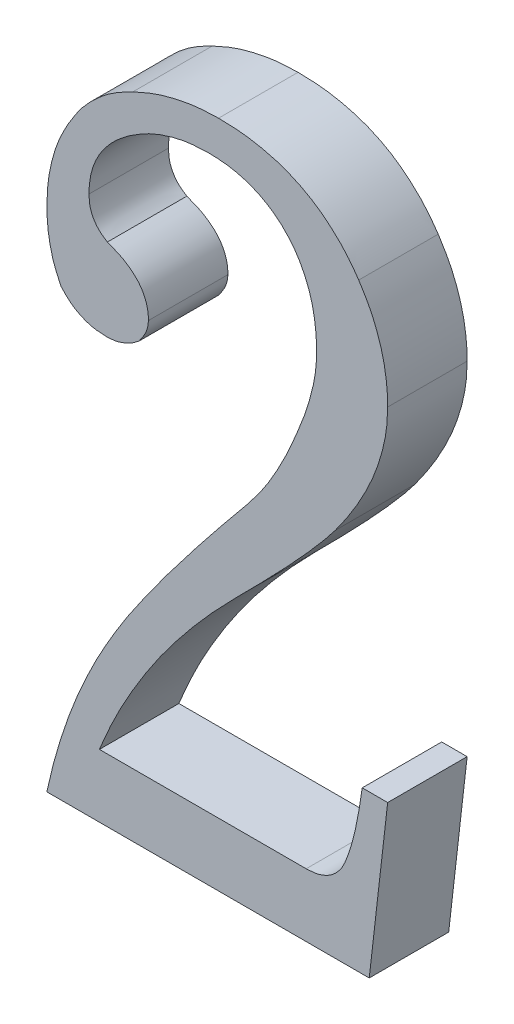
from build123d import *

# Parameters (mm, degrees)
EXTRUDE_1_DEPTH = 3


with BuildPart() as part:
    # Sketch 1 → Extrude 1 (new body)
    with BuildSketch(Plane.XY):
        with BuildLine():
            add(Edge.make_bspline(
                [(8.465608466, 23.941798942), (8.750342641, 23.935820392), (9.303283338, 23.924210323), (10.104258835, 23.789651), (10.85309588, 23.589277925), (11.547029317, 23.295097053), (12.189267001, 22.92368474), (12.769523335, 22.458755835), (13.30951138, 21.925520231), (13.60576116, 21.508596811), (13.756613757, 21.296296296)],
                knots=[0, 0, 0, 0, 1.104744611, 2.145363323, 3.145534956, 4.109100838, 5.064175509, 6.017078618, 6.990281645, 8, 8, 8, 8], degree=3))
            add(Edge.make_bspline(
                [(13.756613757, 21.296296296), (13.843155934, 21.160117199), (14.015133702, 20.88950028), (14.243146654, 20.467888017), (14.426892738, 20.031667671), (14.580773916, 19.584894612), (14.704389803, 19.12878644), (14.784691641, 18.657779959), (14.843545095, 18.178705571), (14.847245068, 17.854063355), (14.849108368, 17.690574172)],
                knots=[0, 0, 0, 0, 1.01232212, 2.011700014, 3.003325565, 3.978723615, 4.975418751, 5.964340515, 6.974845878, 8, 8, 8, 8], degree=3))
            add(Edge.make_bspline(
                [(14.849108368, 17.690574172), (14.843617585, 17.492634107), (14.832485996, 17.091345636), (14.734494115, 16.485706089), (14.575532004, 15.871974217), (14.359385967, 15.246965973), (14.07647565, 14.612659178), (13.733347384, 13.968435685), (13.329289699, 13.312108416), (13.022810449, 12.884385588), (12.864981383, 12.664119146)],
                knots=[0, 0, 0, 0, 0.864090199, 1.751790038, 2.672100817, 3.630749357, 4.636656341, 5.702335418, 6.816760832, 8, 8, 8, 8], degree=3))
            add(Edge.make_bspline(
                [(12.864981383, 12.664119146), (12.774533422, 12.545733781), (12.579214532, 12.290085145), (12.243316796, 11.897989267), (11.862200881, 11.453252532), (11.418007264, 10.970885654), (10.926825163, 10.436737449), (10.373909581, 9.862621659), (9.770032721, 9.243339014), (9.346219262, 8.817939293), (9.126984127, 8.597883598)],
                knots=[0, 0, 0, 0, 0.646827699, 1.396799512, 2.241351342, 3.190131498, 4.243902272, 5.392454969, 6.651138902, 8, 8, 8, 8], degree=3))
            add(Edge.make_bspline(
                [(9.126984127, 8.597883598), (8.836688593, 8.300089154), (8.264426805, 7.713044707), (7.467003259, 6.797686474), (6.723652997, 5.877694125), (6.046148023, 4.940911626), (5.434467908, 3.988866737), (4.878069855, 3.027924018), (4.385201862, 2.05370904), (4.106459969, 1.388182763), (3.968253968, 1.058201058)],
                knots=[0, 0, 0, 0, 1.084957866, 2.138785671, 3.166267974, 4.170334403, 5.153717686, 6.117745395, 7.066739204, 8, 8, 8, 8], degree=3))
            Line((3.968253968, 1.058201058), (11.772486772, 1.058201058))
            add(Edge.make_bspline(
                [(11.772486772, 1.058201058), (11.909291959, 1.06405076), (12.173234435, 1.075336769), (12.539354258, 1.209942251), (12.85908794, 1.420044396), (13.015247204, 1.618116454), (13.095238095, 1.71957672)],
                knots=[0, 0, 0, 0, 1.060846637, 2.046724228, 2.999455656, 4, 4, 4, 4], degree=3))
            add(Edge.make_bspline(
                [(13.095238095, 1.71957672), (13.137761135, 1.797159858), (13.228578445, 1.96285572), (13.336296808, 2.244416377), (13.444598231, 2.562925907), (13.546905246, 2.922784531), (13.644992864, 3.322804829), (13.731489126, 3.766315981), (13.814727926, 4.24983419), (13.863564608, 4.587044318), (13.888888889, 4.761904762)],
                knots=[0, 0, 0, 0, 0.6712659, 1.433636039, 2.284772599, 3.226928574, 4.27380846, 5.412206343, 6.65809859, 8, 8, 8, 8], degree=3))
            Line((13.888888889, 4.761904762), (14.849108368, 4.761904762))
            Line((14.849108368, 4.761904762), (14.153439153, -1.322751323))
            Line((14.153439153, -1.322751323), (1.984126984, -1.322751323))
            add(Edge.make_bspline(
                [(1.984126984, -1.322751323), (2.048570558, -1.034725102), (2.177037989, -0.460548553), (2.413997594, 0.387464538), (2.684686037, 1.222212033), (2.985970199, 2.046139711), (3.332163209, 2.852588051), (3.702356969, 3.649579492), (4.115572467, 4.429564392), (4.415364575, 4.937767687), (4.565941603, 5.193023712)],
                knots=[0, 0, 0, 0, 1.005727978, 2.004905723, 2.999298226, 3.995915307, 4.993417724, 5.989288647, 6.990077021, 8, 8, 8, 8], degree=3))
            add(Edge.make_bspline(
                [(4.565941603, 5.193023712), (4.691823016, 5.398112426), (4.958694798, 5.83290569), (5.415244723, 6.503901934), (5.933267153, 7.243051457), (6.52171592, 8.047592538), (7.184838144, 8.911048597), (7.90918838, 9.845083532), (8.708742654, 10.837642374), (9.268442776, 11.518240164), (9.558103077, 11.870468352)],
                knots=[0, 0, 0, 0, 0.692094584, 1.467258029, 2.333863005, 3.288414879, 4.334061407, 5.465352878, 6.68824998, 8, 8, 8, 8], degree=3))
            add(Edge.make_bspline(
                [(9.558103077, 11.870468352), (9.739161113, 12.100678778), (10.111711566, 12.574366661), (10.593990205, 13.36915119), (11.049087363, 14.239206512), (11.309923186, 14.858449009), (11.444248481, 15.177346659)],
                knots=[0, 0, 0, 0, 0.918961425, 1.890882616, 2.913846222, 4, 4, 4, 4], degree=3))
            add(Edge.make_bspline(
                [(11.444248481, 15.177346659), (11.555512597, 15.451553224), (11.767306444, 15.973511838), (11.98994019, 16.745129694), (12.141121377, 17.452802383), (12.160268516, 17.907111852), (12.169312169, 18.121693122)],
                knots=[0, 0, 0, 0, 1.163169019, 2.21411945, 3.15648574, 4, 4, 4, 4], degree=3))
            add(Edge.make_bspline(
                [(12.169312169, 18.121693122), (12.167114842, 18.28514338), (12.162819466, 18.604659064), (12.111066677, 19.071035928), (12.03499426, 19.513944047), (11.923262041, 19.931074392), (11.774563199, 20.32054872), (11.597238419, 20.684152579), (11.394425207, 21.026444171), (11.228078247, 21.229614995), (11.145404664, 21.330589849)],
                knots=[0, 0, 0, 0, 1.139425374, 2.227370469, 3.268464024, 4.271354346, 5.233786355, 6.171022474, 7.091007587, 8, 8, 8, 8], degree=3))
            add(Edge.make_bspline(
                [(11.145404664, 21.330589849), (11.049877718, 21.434371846), (10.861491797, 21.639037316), (10.537248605, 21.900638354), (10.188285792, 22.121512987), (9.813557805, 22.303819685), (9.414194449, 22.445829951), (8.989466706, 22.550232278), (8.537438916, 22.608010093), (8.227344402, 22.615313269), (8.068783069, 22.619047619)],
                knots=[0, 0, 0, 0, 0.981612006, 1.935808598, 2.892173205, 3.853869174, 4.832708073, 5.83989853, 6.895470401, 8, 8, 8, 8], degree=3))
            add(Edge.make_bspline(
                [(8.068783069, 22.619047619), (7.798148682, 22.60874386), (7.26364402, 22.588393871), (6.484981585, 22.395325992), (5.737598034, 22.101248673), (5.288230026, 21.807520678), (5.060748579, 21.65882814)],
                knots=[0, 0, 0, 0, 1.010792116, 1.996320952, 2.985687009, 4, 4, 4, 4], degree=3))
            add(Edge.make_bspline(
                [(5.060748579, 21.65882814), (4.943029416, 21.569541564), (4.713892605, 21.395747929), (4.408851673, 21.106168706), (4.150318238, 20.799198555), (3.938037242, 20.475860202), (3.774581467, 20.132677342), (3.65602766, 19.774220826), (3.586392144, 19.398130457), (3.576456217, 19.142617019), (3.571428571, 19.013325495)],
                knots=[0, 0, 0, 0, 1.120754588, 2.181515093, 3.184438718, 4.160741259, 5.108704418, 6.061113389, 7.018910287, 8, 8, 8, 8], degree=3))
            add(Edge.make_bspline(
                [(3.571428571, 19.013325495), (3.578509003, 18.882775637), (3.592022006, 18.633621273), (3.734671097, 18.29106344), (3.955294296, 17.997014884), (4.160778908, 17.862864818), (4.267097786, 17.79345483)],
                knots=[0, 0, 0, 0, 1.056783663, 2.016871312, 2.973918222, 4, 4, 4, 4], degree=3))
            add(Edge.make_bspline(
                [(4.267097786, 17.79345483), (4.388961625, 17.748642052), (4.623299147, 17.662469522), (4.943524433, 17.49820358), (5.210737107, 17.302964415), (5.437537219, 17.094524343), (5.606420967, 16.852098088), (5.730414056, 16.590982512), (5.807253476, 16.305145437), (5.815745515, 16.107020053), (5.82010582, 16.005291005)],
                knots=[0, 0, 0, 0, 1.222172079, 2.350170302, 3.374457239, 4.331555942, 5.236069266, 6.137177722, 7.043519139, 8, 8, 8, 8], degree=3))
            add(Edge.make_bspline(
                [(5.82010582, 16.005291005), (5.814170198, 15.937984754), (5.801778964, 15.797475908), (5.735668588, 15.581188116), (5.614252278, 15.363354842), (5.511412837, 15.221970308), (5.457573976, 15.147952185)],
                knots=[0, 0, 0, 0, 0.854877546, 1.784646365, 2.840210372, 4, 4, 4, 4], degree=3))
            add(Edge.make_bspline(
                [(5.457573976, 15.147952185), (5.363669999, 15.075436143), (5.182189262, 14.935290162), (4.874102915, 14.793510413), (4.558498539, 14.699115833), (4.341253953, 14.688059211), (4.232804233, 14.682539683)],
                knots=[0, 0, 0, 0, 1.062222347, 2.05287254, 3.027983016, 4, 4, 4, 4], degree=3))
            add(Edge.make_bspline(
                [(4.232804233, 14.682539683), (4.063206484, 14.690689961), (3.732948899, 14.706560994), (3.268741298, 14.867400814), (2.84861922, 15.116542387), (2.627185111, 15.353991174), (2.513227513, 15.476190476)],
                knots=[0, 0, 0, 0, 1.036424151, 2.018228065, 2.98011209, 4, 4, 4, 4], degree=3))
            add(Edge.make_bspline(
                [(2.513227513, 15.476190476), (2.431767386, 15.650717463), (2.266705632, 16.004359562), (2.103284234, 16.57870348), (2.00392288, 17.189002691), (1.990820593, 17.608526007), (1.984126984, 17.822849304)],
                knots=[0, 0, 0, 0, 0.950916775, 1.926832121, 2.940873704, 4, 4, 4, 4], degree=3))
            add(Edge.make_bspline(
                [(1.984126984, 17.822849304), (1.99248749, 18.099684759), (2.008944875, 18.644626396), (2.170744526, 19.438054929), (2.407952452, 20.19938682), (2.654378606, 20.665874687), (2.777777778, 20.899470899)],
                knots=[0, 0, 0, 0, 1.032817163, 2.033067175, 3.015048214, 4, 4, 4, 4], degree=3))
            add(Edge.make_bspline(
                [(2.777777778, 20.899470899), (2.928117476, 21.147071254), (3.224589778, 21.635343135), (3.806360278, 22.259931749), (4.467826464, 22.794628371), (4.972127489, 23.05213598), (5.227317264, 23.182441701)],
                knots=[0, 0, 0, 0, 1.018679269, 2.008851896, 2.992425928, 4, 4, 4, 4], degree=3))
            add(Edge.make_bspline(
                [(5.227317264, 23.182441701), (5.486037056, 23.300261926), (5.999056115, 23.533889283), (6.809442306, 23.763187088), (7.63208492, 23.913107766), (8.18733447, 23.932220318), (8.465608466, 23.941798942)],
                knots=[0, 0, 0, 0, 1.015891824, 2.01442597, 3.004891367, 4, 4, 4, 4], degree=3))
        make_face()
    extrude(amount=EXTRUDE_1_DEPTH)


solid = part.part
